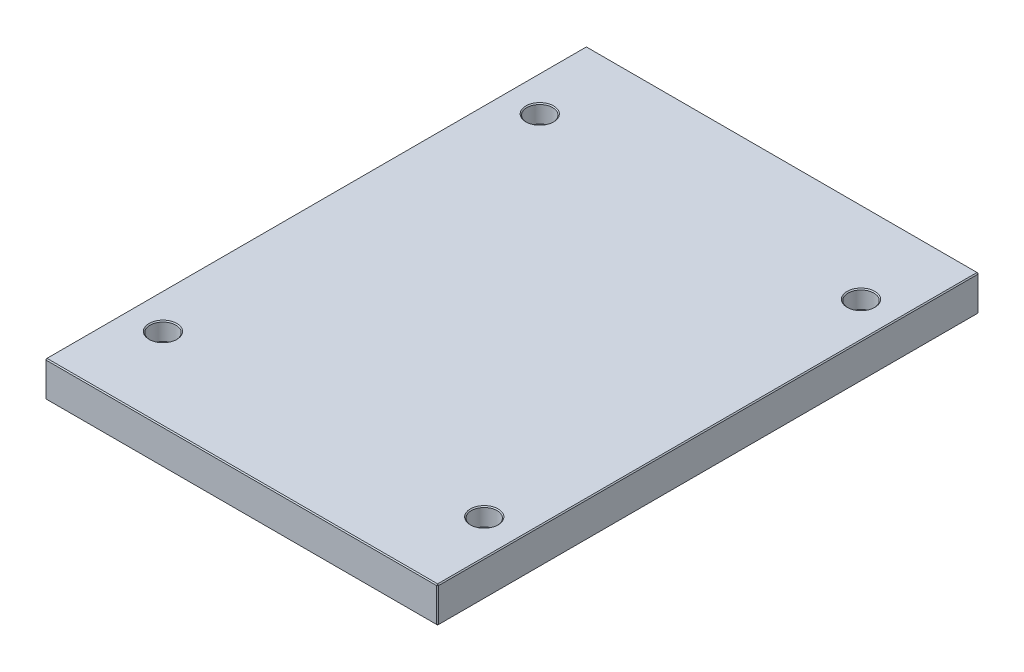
ISO-10303-21;
HEADER;
FILE_DESCRIPTION(('STEP AP214'),'2;1');
FILE_NAME('part.step','',(''),(''),'','','');
FILE_SCHEMA(('AUTOMOTIVE_DESIGN { 1 0 10303 214 1 1 1 1 }'));
ENDSEC;
DATA;
#1=APPLICATION_CONTEXT('core data for automotive mechanical design processes');
#2=APPLICATION_PROTOCOL_DEFINITION('international standard','automotive_design',2000,#1);
#3=PRODUCT_CONTEXT('',#1,'mechanical');
#4=PRODUCT('Part','Part','',(#3));
#5=PRODUCT_RELATED_PRODUCT_CATEGORY('part','',(#4));
#6=PRODUCT_DEFINITION_FORMATION('','',#4);
#7=PRODUCT_DEFINITION_CONTEXT('part definition',#1,'design');
#8=PRODUCT_DEFINITION('design','',#6,#7);
#9=PRODUCT_DEFINITION_SHAPE('','',#8);
#10=(LENGTH_UNIT() NAMED_UNIT(*) SI_UNIT(.MILLI.,.METRE.));
#11=(NAMED_UNIT(*) PLANE_ANGLE_UNIT() SI_UNIT($,.RADIAN.));
#12=(NAMED_UNIT(*) SI_UNIT($,.STERADIAN.) SOLID_ANGLE_UNIT());
#13=UNCERTAINTY_MEASURE_WITH_UNIT(LENGTH_MEASURE(1.E-05),#10,'distance_accuracy_value','');
#14=(GEOMETRIC_REPRESENTATION_CONTEXT(3) GLOBAL_UNCERTAINTY_ASSIGNED_CONTEXT((#13)) GLOBAL_UNIT_ASSIGNED_CONTEXT((#10,
#11,#12)) REPRESENTATION_CONTEXT('',''));
#15=CARTESIAN_POINT('',(0.,0.,0.));
#16=DIRECTION('',(0.,0.,1.));
#17=DIRECTION('',(1.,0.,0.));
#18=AXIS2_PLACEMENT_3D('',#15,#16,#17);
#19=CARTESIAN_POINT('',(-198.,36.,273.));
#20=DIRECTION('',(1.,0.,0.));
#21=DIRECTION('',(0.,0.,-1.));
#22=AXIS2_PLACEMENT_3D('',#19,#20,#21);
#23=PLANE('',#22);
#24=DIRECTION('',(0.,-1.,0.));
#25=VECTOR('',#24,1.);
#26=CARTESIAN_POINT('',(-198.,36.,-272.));
#27=LINE('',#26,#25);
#28=CARTESIAN_POINT('',(-198.,35.,-272.));
#29=VERTEX_POINT('',#28);
#30=CARTESIAN_POINT('',(-198.,1.,-272.));
#31=VERTEX_POINT('',#30);
#32=EDGE_CURVE('E115',#29,#31,#27,.T.);
#33=ORIENTED_EDGE('',*,*,#32,.T.);
#34=DIRECTION('',(0.,0.,1.));
#35=VECTOR('',#34,1.);
#36=CARTESIAN_POINT('',(-198.,1.,273.));
#37=LINE('',#36,#35);
#38=CARTESIAN_POINT('',(-198.,1.,272.));
#39=VERTEX_POINT('',#38);
#40=EDGE_CURVE('E111',#31,#39,#37,.T.);
#41=ORIENTED_EDGE('',*,*,#40,.T.);
#42=DIRECTION('',(0.,1.,0.));
#43=VECTOR('',#42,1.);
#44=CARTESIAN_POINT('',(-198.,36.,272.));
#45=LINE('',#44,#43);
#46=CARTESIAN_POINT('',(-198.,35.,272.));
#47=VERTEX_POINT('',#46);
#48=EDGE_CURVE('E104',#39,#47,#45,.T.);
#49=ORIENTED_EDGE('',*,*,#48,.T.);
#50=DIRECTION('',(0.,0.,-1.));
#51=VECTOR('',#50,1.);
#52=CARTESIAN_POINT('',(-198.,35.,-273.));
#53=LINE('',#52,#51);
#54=EDGE_CURVE('E108',#47,#29,#53,.T.);
#55=ORIENTED_EDGE('',*,*,#54,.T.);
#56=EDGE_LOOP('',(#33,#41,#49,#55));
#57=FACE_BOUND('',#56,.T.);
#58=ADVANCED_FACE('F16',(#57),#23,.F.);
#59=CARTESIAN_POINT('',(198.,36.,273.));
#60=DIRECTION('',(0.,0.,-1.));
#61=DIRECTION('',(-1.,0.,0.));
#62=AXIS2_PLACEMENT_3D('',#59,#60,#61);
#63=PLANE('',#62);
#64=DIRECTION('',(-1.,0.,0.));
#65=VECTOR('',#64,1.);
#66=CARTESIAN_POINT('',(-198.,35.,273.));
#67=LINE('',#66,#65);
#68=CARTESIAN_POINT('',(197.,35.,273.));
#69=VERTEX_POINT('',#68);
#70=CARTESIAN_POINT('',(-197.,35.,273.));
#71=VERTEX_POINT('',#70);
#72=EDGE_CURVE('E170',#69,#71,#67,.T.);
#73=ORIENTED_EDGE('',*,*,#72,.T.);
#74=DIRECTION('',(0.,-1.,0.));
#75=VECTOR('',#74,1.);
#76=CARTESIAN_POINT('',(-197.,36.,273.));
#77=LINE('',#76,#75);
#78=CARTESIAN_POINT('',(-197.,1.,273.));
#79=VERTEX_POINT('',#78);
#80=EDGE_CURVE('E123',#71,#79,#77,.T.);
#81=ORIENTED_EDGE('',*,*,#80,.T.);
#82=DIRECTION('',(1.,0.,0.));
#83=VECTOR('',#82,1.);
#84=CARTESIAN_POINT('',(198.,1.,273.));
#85=LINE('',#84,#83);
#86=CARTESIAN_POINT('',(197.,1.,273.));
#87=VERTEX_POINT('',#86);
#88=EDGE_CURVE('E174',#79,#87,#85,.T.);
#89=ORIENTED_EDGE('',*,*,#88,.T.);
#90=DIRECTION('',(0.,1.,0.));
#91=VECTOR('',#90,1.);
#92=CARTESIAN_POINT('',(197.,36.,273.));
#93=LINE('',#92,#91);
#94=EDGE_CURVE('E172',#87,#69,#93,.T.);
#95=ORIENTED_EDGE('',*,*,#94,.T.);
#96=EDGE_LOOP('',(#73,#81,#89,#95));
#97=FACE_BOUND('',#96,.T.);
#98=ADVANCED_FACE('F317',(#97),#63,.F.);
#99=CARTESIAN_POINT('',(198.,36.,273.));
#100=DIRECTION('',(-1.,0.,0.));
#101=DIRECTION('',(0.,0.,1.));
#102=AXIS2_PLACEMENT_3D('',#99,#100,#101);
#103=PLANE('',#102);
#104=DIRECTION('',(0.,0.,-1.));
#105=VECTOR('',#104,1.);
#106=CARTESIAN_POINT('',(198.,1.,273.));
#107=LINE('',#106,#105);
#108=CARTESIAN_POINT('',(198.,1.,272.));
#109=VERTEX_POINT('',#108);
#110=CARTESIAN_POINT('',(198.,1.,-272.));
#111=VERTEX_POINT('',#110);
#112=EDGE_CURVE('E165',#109,#111,#107,.T.);
#113=ORIENTED_EDGE('',*,*,#112,.T.);
#114=DIRECTION('',(0.,1.,0.));
#115=VECTOR('',#114,1.);
#116=CARTESIAN_POINT('',(198.,36.,-272.));
#117=LINE('',#116,#115);
#118=CARTESIAN_POINT('',(198.,35.,-272.));
#119=VERTEX_POINT('',#118);
#120=EDGE_CURVE('E167',#111,#119,#117,.T.);
#121=ORIENTED_EDGE('',*,*,#120,.T.);
#122=DIRECTION('',(0.,0.,1.));
#123=VECTOR('',#122,1.);
#124=CARTESIAN_POINT('',(198.,35.,273.));
#125=LINE('',#124,#123);
#126=CARTESIAN_POINT('',(198.,35.,272.));
#127=VERTEX_POINT('',#126);
#128=EDGE_CURVE('E161',#119,#127,#125,.T.);
#129=ORIENTED_EDGE('',*,*,#128,.T.);
#130=DIRECTION('',(0.,-1.,0.));
#131=VECTOR('',#130,1.);
#132=CARTESIAN_POINT('',(198.,36.,272.));
#133=LINE('',#132,#131);
#134=EDGE_CURVE('E163',#127,#109,#133,.T.);
#135=ORIENTED_EDGE('',*,*,#134,.T.);
#136=EDGE_LOOP('',(#113,#121,#129,#135));
#137=FACE_BOUND('',#136,.T.);
#138=ADVANCED_FACE('F323',(#137),#103,.F.);
#139=CARTESIAN_POINT('',(198.,36.,-273.));
#140=DIRECTION('',(0.,0.,1.));
#141=DIRECTION('',(1.,0.,0.));
#142=AXIS2_PLACEMENT_3D('',#139,#140,#141);
#143=PLANE('',#142);
#144=DIRECTION('',(0.,-1.,0.));
#145=VECTOR('',#144,1.);
#146=CARTESIAN_POINT('',(197.,36.,-273.));
#147=LINE('',#146,#145);
#148=CARTESIAN_POINT('',(197.,35.,-273.));
#149=VERTEX_POINT('',#148);
#150=CARTESIAN_POINT('',(197.,1.,-273.));
#151=VERTEX_POINT('',#150);
#152=EDGE_CURVE('E154',#149,#151,#147,.T.);
#153=ORIENTED_EDGE('',*,*,#152,.T.);
#154=DIRECTION('',(-1.,0.,0.));
#155=VECTOR('',#154,1.);
#156=CARTESIAN_POINT('',(198.,1.,-273.));
#157=LINE('',#156,#155);
#158=CARTESIAN_POINT('',(-197.,1.,-273.));
#159=VERTEX_POINT('',#158);
#160=EDGE_CURVE('E159',#151,#159,#157,.T.);
#161=ORIENTED_EDGE('',*,*,#160,.T.);
#162=DIRECTION('',(0.,1.,0.));
#163=VECTOR('',#162,1.);
#164=CARTESIAN_POINT('',(-197.,36.,-273.));
#165=LINE('',#164,#163);
#166=CARTESIAN_POINT('',(-197.,35.,-273.));
#167=VERTEX_POINT('',#166);
#168=EDGE_CURVE('E156',#159,#167,#165,.T.);
#169=ORIENTED_EDGE('',*,*,#168,.T.);
#170=DIRECTION('',(1.,0.,0.));
#171=VECTOR('',#170,1.);
#172=CARTESIAN_POINT('',(198.,35.,-273.));
#173=LINE('',#172,#171);
#174=EDGE_CURVE('E152',#167,#149,#173,.T.);
#175=ORIENTED_EDGE('',*,*,#174,.T.);
#176=EDGE_LOOP('',(#153,#161,#169,#175));
#177=FACE_BOUND('',#176,.T.);
#178=ADVANCED_FACE('F465',(#177),#143,.F.);
#179=CARTESIAN_POINT('',(0.,36.,0.));
#180=DIRECTION('',(0.,1.,0.));
#181=DIRECTION('',(0.,0.,1.));
#182=AXIS2_PLACEMENT_3D('',#179,#180,#181);
#183=PLANE('',#182);
#184=CARTESIAN_POINT('',(-162.,36.,190.));
#185=DIRECTION('',(0.,1.,0.));
#186=DIRECTION('',(0.,0.,1.));
#187=AXIS2_PLACEMENT_3D('',#184,#185,#186);
#188=CIRCLE('',#187,14.);
#189=CARTESIAN_POINT('',(-162.,36.,204.));
#190=VERTEX_POINT('',#189);
#191=EDGE_CURVE('E290',#190,#190,#188,.F.);
#192=ORIENTED_EDGE('',*,*,#191,.T.);
#193=EDGE_LOOP('',(#192));
#194=FACE_BOUND('',#193,.T.);
#195=CARTESIAN_POINT('',(162.,36.,190.));
#196=DIRECTION('',(0.,1.,0.));
#197=DIRECTION('',(0.,0.,1.));
#198=AXIS2_PLACEMENT_3D('',#195,#196,#197);
#199=CIRCLE('',#198,14.);
#200=CARTESIAN_POINT('',(162.,36.,204.));
#201=VERTEX_POINT('',#200);
#202=EDGE_CURVE('E287',#201,#201,#199,.F.);
#203=ORIENTED_EDGE('',*,*,#202,.T.);
#204=EDGE_LOOP('',(#203));
#205=FACE_BOUND('',#204,.T.);
#206=CARTESIAN_POINT('',(162.,36.,-190.));
#207=DIRECTION('',(0.,1.,0.));
#208=DIRECTION('',(0.,0.,1.));
#209=AXIS2_PLACEMENT_3D('',#206,#207,#208);
#210=CIRCLE('',#209,14.);
#211=CARTESIAN_POINT('',(162.,36.,-176.));
#212=VERTEX_POINT('',#211);
#213=EDGE_CURVE('E284',#212,#212,#210,.F.);
#214=ORIENTED_EDGE('',*,*,#213,.T.);
#215=EDGE_LOOP('',(#214));
#216=FACE_BOUND('',#215,.T.);
#217=CARTESIAN_POINT('',(-162.,36.,-190.));
#218=DIRECTION('',(0.,1.,0.));
#219=DIRECTION('',(0.,0.,1.));
#220=AXIS2_PLACEMENT_3D('',#217,#218,#219);
#221=CIRCLE('',#220,14.);
#222=CARTESIAN_POINT('',(-162.,36.,-176.));
#223=VERTEX_POINT('',#222);
#224=EDGE_CURVE('E281',#223,#223,#221,.F.);
#225=ORIENTED_EDGE('',*,*,#224,.T.);
#226=EDGE_LOOP('',(#225));
#227=FACE_BOUND('',#226,.T.);
#228=DIRECTION('',(0.,0.,-1.));
#229=VECTOR('',#228,1.);
#230=CARTESIAN_POINT('',(197.,36.,-273.));
#231=LINE('',#230,#229);
#232=CARTESIAN_POINT('',(197.,36.,272.));
#233=VERTEX_POINT('',#232);
#234=CARTESIAN_POINT('',(197.,36.,-272.));
#235=VERTEX_POINT('',#234);
#236=EDGE_CURVE('E31',#233,#235,#231,.T.);
#237=ORIENTED_EDGE('',*,*,#236,.T.);
#238=DIRECTION('',(-1.,0.,0.));
#239=VECTOR('',#238,1.);
#240=CARTESIAN_POINT('',(-198.,36.,-272.));
#241=LINE('',#240,#239);
#242=CARTESIAN_POINT('',(-197.,36.,-272.));
#243=VERTEX_POINT('',#242);
#244=EDGE_CURVE('E190',#235,#243,#241,.T.);
#245=ORIENTED_EDGE('',*,*,#244,.T.);
#246=DIRECTION('',(0.,0.,1.));
#247=VECTOR('',#246,1.);
#248=CARTESIAN_POINT('',(-197.,36.,273.));
#249=LINE('',#248,#247);
#250=CARTESIAN_POINT('',(-197.,36.,272.));
#251=VERTEX_POINT('',#250);
#252=EDGE_CURVE('E186',#243,#251,#249,.T.);
#253=ORIENTED_EDGE('',*,*,#252,.T.);
#254=DIRECTION('',(1.,0.,0.));
#255=VECTOR('',#254,1.);
#256=CARTESIAN_POINT('',(198.,36.,272.));
#257=LINE('',#256,#255);
#258=EDGE_CURVE('E36',#251,#233,#257,.T.);
#259=ORIENTED_EDGE('',*,*,#258,.T.);
#260=EDGE_LOOP('',(#237,#245,#253,#259));
#261=FACE_BOUND('',#260,.T.);
#262=ADVANCED_FACE('F462',(#194,#205,#216,#227,#261),#183,.T.);
#263=CARTESIAN_POINT('',(0.,0.,0.));
#264=DIRECTION('',(0.,1.,0.));
#265=DIRECTION('',(0.,0.,1.));
#266=AXIS2_PLACEMENT_3D('',#263,#264,#265);
#267=PLANE('',#266);
#268=CARTESIAN_POINT('',(162.,0.,-190.));
#269=DIRECTION('',(0.,1.,0.));
#270=DIRECTION('',(0.,0.,1.));
#271=AXIS2_PLACEMENT_3D('',#268,#269,#270);
#272=CIRCLE('',#271,9.99999999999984);
#273=CARTESIAN_POINT('',(162.,0.,-180.));
#274=VERTEX_POINT('',#273);
#275=EDGE_CURVE('E263',#274,#274,#272,.T.);
#276=ORIENTED_EDGE('',*,*,#275,.T.);
#277=EDGE_LOOP('',(#276));
#278=FACE_BOUND('',#277,.T.);
#279=CARTESIAN_POINT('',(162.,0.,190.));
#280=DIRECTION('',(0.,1.,0.));
#281=DIRECTION('',(0.,0.,1.));
#282=AXIS2_PLACEMENT_3D('',#279,#280,#281);
#283=CIRCLE('',#282,9.99999999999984);
#284=CARTESIAN_POINT('',(162.,0.,200.));
#285=VERTEX_POINT('',#284);
#286=EDGE_CURVE('E260',#285,#285,#283,.T.);
#287=ORIENTED_EDGE('',*,*,#286,.T.);
#288=EDGE_LOOP('',(#287));
#289=FACE_BOUND('',#288,.T.);
#290=CARTESIAN_POINT('',(-162.,0.,190.));
#291=DIRECTION('',(0.,1.,0.));
#292=DIRECTION('',(0.,0.,1.));
#293=AXIS2_PLACEMENT_3D('',#290,#291,#292);
#294=CIRCLE('',#293,10.);
#295=CARTESIAN_POINT('',(-162.,0.,200.));
#296=VERTEX_POINT('',#295);
#297=EDGE_CURVE('E257',#296,#296,#294,.T.);
#298=ORIENTED_EDGE('',*,*,#297,.T.);
#299=EDGE_LOOP('',(#298));
#300=FACE_BOUND('',#299,.T.);
#301=CARTESIAN_POINT('',(-162.,0.,-190.));
#302=DIRECTION('',(0.,1.,0.));
#303=DIRECTION('',(0.,0.,1.));
#304=AXIS2_PLACEMENT_3D('',#301,#302,#303);
#305=CIRCLE('',#304,10.);
#306=CARTESIAN_POINT('',(-162.,0.,-180.));
#307=VERTEX_POINT('',#306);
#308=EDGE_CURVE('E192',#307,#307,#305,.T.);
#309=ORIENTED_EDGE('',*,*,#308,.T.);
#310=EDGE_LOOP('',(#309));
#311=FACE_BOUND('',#310,.T.);
#312=DIRECTION('',(0.,0.,1.));
#313=VECTOR('',#312,1.);
#314=CARTESIAN_POINT('',(197.,0.,0.));
#315=LINE('',#314,#313);
#316=CARTESIAN_POINT('',(197.,0.,-272.));
#317=VERTEX_POINT('',#316);
#318=CARTESIAN_POINT('',(197.,0.,272.));
#319=VERTEX_POINT('',#318);
#320=EDGE_CURVE('E177',#317,#319,#315,.T.);
#321=ORIENTED_EDGE('',*,*,#320,.T.);
#322=DIRECTION('',(-1.,0.,0.));
#323=VECTOR('',#322,1.);
#324=CARTESIAN_POINT('',(0.,0.,272.));
#325=LINE('',#324,#323);
#326=CARTESIAN_POINT('',(-197.,0.,272.));
#327=VERTEX_POINT('',#326);
#328=EDGE_CURVE('E183',#319,#327,#325,.T.);
#329=ORIENTED_EDGE('',*,*,#328,.T.);
#330=DIRECTION('',(0.,0.,-1.));
#331=VECTOR('',#330,1.);
#332=CARTESIAN_POINT('',(-197.,0.,0.));
#333=LINE('',#332,#331);
#334=CARTESIAN_POINT('',(-197.,0.,-272.));
#335=VERTEX_POINT('',#334);
#336=EDGE_CURVE('E181',#327,#335,#333,.T.);
#337=ORIENTED_EDGE('',*,*,#336,.T.);
#338=DIRECTION('',(1.,0.,0.));
#339=VECTOR('',#338,1.);
#340=CARTESIAN_POINT('',(0.,0.,-272.));
#341=LINE('',#340,#339);
#342=EDGE_CURVE('E179',#335,#317,#341,.T.);
#343=ORIENTED_EDGE('',*,*,#342,.T.);
#344=EDGE_LOOP('',(#321,#329,#337,#343));
#345=FACE_BOUND('',#344,.T.);
#346=ADVANCED_FACE('F402',(#278,#289,#300,#311,#345),#267,.F.);
#347=CARTESIAN_POINT('',(198.,36.,272.));
#348=DIRECTION('',(-0.707106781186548,0.,-0.707106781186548));
#349=DIRECTION('',(0.,-1.,0.));
#350=AXIS2_PLACEMENT_3D('',#347,#348,#349);
#351=PLANE('',#350);
#352=DIRECTION('',(-0.707106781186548,0.,0.707106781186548));
#353=VECTOR('',#352,1.);
#354=CARTESIAN_POINT('',(197.,35.,273.));
#355=LINE('',#354,#353);
#356=EDGE_CURVE('E141',#69,#127,#355,.F.);
#357=ORIENTED_EDGE('',*,*,#356,.F.);
#358=ORIENTED_EDGE('',*,*,#94,.F.);
#359=DIRECTION('',(0.707106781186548,0.,-0.707106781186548));
#360=VECTOR('',#359,1.);
#361=CARTESIAN_POINT('',(197.,1.,273.));
#362=LINE('',#361,#360);
#363=EDGE_CURVE('E144',#109,#87,#362,.F.);
#364=ORIENTED_EDGE('',*,*,#363,.F.);
#365=ORIENTED_EDGE('',*,*,#134,.F.);
#366=EDGE_LOOP('',(#357,#358,#364,#365));
#367=FACE_BOUND('',#366,.T.);
#368=ADVANCED_FACE('F398',(#367),#351,.F.);
#369=CARTESIAN_POINT('',(197.,35.,273.));
#370=DIRECTION('',(0.577350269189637,0.577350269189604,0.577350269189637));
#371=DIRECTION('',(0.707106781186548,0.,-0.707106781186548));
#372=AXIS2_PLACEMENT_3D('',#369,#370,#371);
#373=PLANE('',#372);
#374=DIRECTION('',(0.,-0.707106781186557,0.707106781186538));
#375=VECTOR('',#374,1.);
#376=CARTESIAN_POINT('',(197.,35.,273.));
#377=LINE('',#376,#375);
#378=EDGE_CURVE('E235',#69,#233,#377,.F.);
#379=ORIENTED_EDGE('',*,*,#378,.F.);
#380=ORIENTED_EDGE('',*,*,#356,.T.);
#381=DIRECTION('',(-0.707106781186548,0.707106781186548,0.));
#382=VECTOR('',#381,1.);
#383=CARTESIAN_POINT('',(197.5,35.5,272.));
#384=LINE('',#383,#382);
#385=EDGE_CURVE('E237',#233,#127,#384,.F.);
#386=ORIENTED_EDGE('',*,*,#385,.F.);
#387=EDGE_LOOP('',(#379,#380,#386));
#388=FACE_BOUND('',#387,.T.);
#389=ADVANCED_FACE('F394',(#388),#373,.T.);
#390=CARTESIAN_POINT('',(197.,1.,273.));
#391=DIRECTION('',(0.577350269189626,-0.577350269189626,0.577350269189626));
#392=DIRECTION('',(0.707106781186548,0.,-0.707106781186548));
#393=AXIS2_PLACEMENT_3D('',#390,#391,#392);
#394=PLANE('',#393);
#395=DIRECTION('',(-0.707106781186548,-0.707106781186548,0.));
#396=VECTOR('',#395,1.);
#397=CARTESIAN_POINT('',(197.5,0.5,272.));
#398=LINE('',#397,#396);
#399=EDGE_CURVE('E229',#109,#319,#398,.T.);
#400=ORIENTED_EDGE('',*,*,#399,.F.);
#401=ORIENTED_EDGE('',*,*,#363,.T.);
#402=DIRECTION('',(0.,0.707106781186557,0.707106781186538));
#403=VECTOR('',#402,1.);
#404=CARTESIAN_POINT('',(197.,1.,273.));
#405=LINE('',#404,#403);
#406=EDGE_CURVE('E232',#319,#87,#405,.T.);
#407=ORIENTED_EDGE('',*,*,#406,.F.);
#408=EDGE_LOOP('',(#400,#401,#407));
#409=FACE_BOUND('',#408,.T.);
#410=ADVANCED_FACE('F390',(#409),#394,.T.);
#411=CARTESIAN_POINT('',(197.,36.,0.));
#412=DIRECTION('',(0.707106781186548,0.707106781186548,0.));
#413=DIRECTION('',(0.,0.,1.));
#414=AXIS2_PLACEMENT_3D('',#411,#412,#413);
#415=PLANE('',#414);
#416=ORIENTED_EDGE('',*,*,#385,.T.);
#417=ORIENTED_EDGE('',*,*,#128,.F.);
#418=DIRECTION('',(0.707106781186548,-0.707106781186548,0.));
#419=VECTOR('',#418,1.);
#420=CARTESIAN_POINT('',(198.,35.,-272.));
#421=LINE('',#420,#419);
#422=EDGE_CURVE('E224',#235,#119,#421,.T.);
#423=ORIENTED_EDGE('',*,*,#422,.F.);
#424=ORIENTED_EDGE('',*,*,#236,.F.);
#425=EDGE_LOOP('',(#416,#417,#423,#424));
#426=FACE_BOUND('',#425,.T.);
#427=ADVANCED_FACE('F386',(#426),#415,.T.);
#428=CARTESIAN_POINT('',(0.,36.,272.));
#429=DIRECTION('',(0.,0.707106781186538,0.707106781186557));
#430=DIRECTION('',(-1.,0.,0.));
#431=AXIS2_PLACEMENT_3D('',#428,#429,#430);
#432=PLANE('',#431);
#433=ORIENTED_EDGE('',*,*,#378,.T.);
#434=ORIENTED_EDGE('',*,*,#258,.F.);
#435=DIRECTION('',(0.,0.707106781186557,-0.707106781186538));
#436=VECTOR('',#435,1.);
#437=CARTESIAN_POINT('',(-197.,35.5,272.5));
#438=LINE('',#437,#436);
#439=EDGE_CURVE('E127',#71,#251,#438,.T.);
#440=ORIENTED_EDGE('',*,*,#439,.F.);
#441=ORIENTED_EDGE('',*,*,#72,.F.);
#442=EDGE_LOOP('',(#433,#434,#440,#441));
#443=FACE_BOUND('',#442,.T.);
#444=ADVANCED_FACE('F383',(#443),#432,.T.);
#445=CARTESIAN_POINT('',(-197.,36.,273.));
#446=DIRECTION('',(0.707106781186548,0.,-0.707106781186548));
#447=DIRECTION('',(0.,-1.,0.));
#448=AXIS2_PLACEMENT_3D('',#445,#446,#447);
#449=PLANE('',#448);
#450=DIRECTION('',(0.707106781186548,0.,0.707106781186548));
#451=VECTOR('',#450,1.);
#452=CARTESIAN_POINT('',(-197.,1.,273.));
#453=LINE('',#452,#451);
#454=EDGE_CURVE('E128',#79,#39,#453,.F.);
#455=ORIENTED_EDGE('',*,*,#454,.F.);
#456=ORIENTED_EDGE('',*,*,#80,.F.);
#457=DIRECTION('',(-0.707106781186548,0.,-0.707106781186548));
#458=VECTOR('',#457,1.);
#459=CARTESIAN_POINT('',(-198.,35.,272.));
#460=LINE('',#459,#458);
#461=EDGE_CURVE('E119',#47,#71,#460,.F.);
#462=ORIENTED_EDGE('',*,*,#461,.F.);
#463=ORIENTED_EDGE('',*,*,#48,.F.);
#464=EDGE_LOOP('',(#455,#456,#462,#463));
#465=FACE_BOUND('',#464,.T.);
#466=ADVANCED_FACE('F121',(#465),#449,.F.);
#467=CARTESIAN_POINT('',(198.,1.,273.));
#468=DIRECTION('',(0.,0.707106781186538,-0.707106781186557));
#469=DIRECTION('',(1.,0.,0.));
#470=AXIS2_PLACEMENT_3D('',#467,#468,#469);
#471=PLANE('',#470);
#472=ORIENTED_EDGE('',*,*,#406,.T.);
#473=ORIENTED_EDGE('',*,*,#88,.F.);
#474=DIRECTION('',(0.,-0.707106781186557,-0.707106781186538));
#475=VECTOR('',#474,1.);
#476=CARTESIAN_POINT('',(-197.,1.,273.));
#477=LINE('',#476,#475);
#478=EDGE_CURVE('E220',#327,#79,#477,.F.);
#479=ORIENTED_EDGE('',*,*,#478,.F.);
#480=ORIENTED_EDGE('',*,*,#328,.F.);
#481=EDGE_LOOP('',(#472,#473,#479,#480));
#482=FACE_BOUND('',#481,.T.);
#483=ADVANCED_FACE('F376',(#482),#471,.F.);
#484=CARTESIAN_POINT('',(198.,1.,273.));
#485=DIRECTION('',(-0.707106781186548,0.707106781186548,0.));
#486=DIRECTION('',(0.,0.,-1.));
#487=AXIS2_PLACEMENT_3D('',#484,#485,#486);
#488=PLANE('',#487);
#489=ORIENTED_EDGE('',*,*,#399,.T.);
#490=ORIENTED_EDGE('',*,*,#320,.F.);
#491=DIRECTION('',(0.707106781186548,0.707106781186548,0.));
#492=VECTOR('',#491,1.);
#493=CARTESIAN_POINT('',(197.5,0.500000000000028,-272.));
#494=LINE('',#493,#492);
#495=EDGE_CURVE('E217',#111,#317,#494,.F.);
#496=ORIENTED_EDGE('',*,*,#495,.F.);
#497=ORIENTED_EDGE('',*,*,#112,.F.);
#498=EDGE_LOOP('',(#489,#490,#496,#497));
#499=FACE_BOUND('',#498,.T.);
#500=ADVANCED_FACE('F372',(#499),#488,.F.);
#501=CARTESIAN_POINT('',(197.,36.,-273.));
#502=DIRECTION('',(-0.707106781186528,0.,0.707106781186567));
#503=DIRECTION('',(0.,-1.,0.));
#504=AXIS2_PLACEMENT_3D('',#501,#502,#503);
#505=PLANE('',#504);
#506=DIRECTION('',(0.707106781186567,0.,0.707106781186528));
#507=VECTOR('',#506,1.);
#508=CARTESIAN_POINT('',(198.,35.,-272.));
#509=LINE('',#508,#507);
#510=EDGE_CURVE('E226',#119,#149,#509,.F.);
#511=ORIENTED_EDGE('',*,*,#510,.F.);
#512=ORIENTED_EDGE('',*,*,#120,.F.);
#513=DIRECTION('',(-0.707106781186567,0.,-0.707106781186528));
#514=VECTOR('',#513,1.);
#515=CARTESIAN_POINT('',(197.,1.,-273.));
#516=LINE('',#515,#514);
#517=EDGE_CURVE('E214',#151,#111,#516,.F.);
#518=ORIENTED_EDGE('',*,*,#517,.F.);
#519=ORIENTED_EDGE('',*,*,#152,.F.);
#520=EDGE_LOOP('',(#511,#512,#518,#519));
#521=FACE_BOUND('',#520,.T.);
#522=ADVANCED_FACE('F368',(#521),#505,.F.);
#523=CARTESIAN_POINT('',(198.,35.,-272.));
#524=DIRECTION('',(0.577350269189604,0.577350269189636,-0.577350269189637));
#525=DIRECTION('',(0.,0.707106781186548,0.707106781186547));
#526=AXIS2_PLACEMENT_3D('',#523,#524,#525);
#527=PLANE('',#526);
#528=ORIENTED_EDGE('',*,*,#422,.T.);
#529=ORIENTED_EDGE('',*,*,#510,.T.);
#530=DIRECTION('',(0.,0.707106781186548,0.707106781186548));
#531=VECTOR('',#530,1.);
#532=CARTESIAN_POINT('',(197.,35.5,-272.5));
#533=LINE('',#532,#531);
#534=EDGE_CURVE('E135',#235,#149,#533,.F.);
#535=ORIENTED_EDGE('',*,*,#534,.F.);
#536=EDGE_LOOP('',(#528,#529,#535));
#537=FACE_BOUND('',#536,.T.);
#538=ADVANCED_FACE('F365',(#537),#527,.T.);
#539=CARTESIAN_POINT('',(-198.,35.,272.));
#540=DIRECTION('',(-0.577350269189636,0.577350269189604,0.577350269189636));
#541=DIRECTION('',(0.707106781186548,0.,0.707106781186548));
#542=AXIS2_PLACEMENT_3D('',#539,#540,#541);
#543=PLANE('',#542);
#544=ORIENTED_EDGE('',*,*,#461,.T.);
#545=ORIENTED_EDGE('',*,*,#439,.T.);
#546=DIRECTION('',(-0.707106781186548,-0.707106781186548,0.));
#547=VECTOR('',#546,1.);
#548=CARTESIAN_POINT('',(-198.,35.,272.));
#549=LINE('',#548,#547);
#550=EDGE_CURVE('E131',#47,#251,#549,.F.);
#551=ORIENTED_EDGE('',*,*,#550,.F.);
#552=EDGE_LOOP('',(#544,#545,#551));
#553=FACE_BOUND('',#552,.T.);
#554=ADVANCED_FACE('F132',(#553),#543,.T.);
#555=CARTESIAN_POINT('',(-197.,1.,273.));
#556=DIRECTION('',(-0.577350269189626,-0.577350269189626,0.577350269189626));
#557=DIRECTION('',(0.707106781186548,0.,0.707106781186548));
#558=AXIS2_PLACEMENT_3D('',#555,#556,#557);
#559=PLANE('',#558);
#560=ORIENTED_EDGE('',*,*,#478,.T.);
#561=ORIENTED_EDGE('',*,*,#454,.T.);
#562=DIRECTION('',(-0.707106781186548,0.707106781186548,0.));
#563=VECTOR('',#562,1.);
#564=CARTESIAN_POINT('',(-197.5,0.5,272.));
#565=LINE('',#564,#563);
#566=EDGE_CURVE('E136',#327,#39,#565,.T.);
#567=ORIENTED_EDGE('',*,*,#566,.F.);
#568=EDGE_LOOP('',(#560,#561,#567));
#569=FACE_BOUND('',#568,.T.);
#570=ADVANCED_FACE('F358',(#569),#559,.T.);
#571=CARTESIAN_POINT('',(197.,1.,-273.));
#572=DIRECTION('',(0.577350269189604,-0.577350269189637,-0.577350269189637));
#573=DIRECTION('',(0.,0.707106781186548,-0.707106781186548));
#574=AXIS2_PLACEMENT_3D('',#571,#572,#573);
#575=PLANE('',#574);
#576=ORIENTED_EDGE('',*,*,#517,.T.);
#577=ORIENTED_EDGE('',*,*,#495,.T.);
#578=DIRECTION('',(0.,-0.707106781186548,0.707106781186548));
#579=VECTOR('',#578,1.);
#580=CARTESIAN_POINT('',(197.,1.,-273.));
#581=LINE('',#580,#579);
#582=EDGE_CURVE('E207',#151,#317,#581,.T.);
#583=ORIENTED_EDGE('',*,*,#582,.F.);
#584=EDGE_LOOP('',(#576,#577,#583));
#585=FACE_BOUND('',#584,.T.);
#586=ADVANCED_FACE('F354',(#585),#575,.T.);
#587=CARTESIAN_POINT('',(0.,36.,-272.));
#588=DIRECTION('',(0.,0.707106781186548,-0.707106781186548));
#589=DIRECTION('',(1.,0.,0.));
#590=AXIS2_PLACEMENT_3D('',#587,#588,#589);
#591=PLANE('',#590);
#592=ORIENTED_EDGE('',*,*,#534,.T.);
#593=ORIENTED_EDGE('',*,*,#174,.F.);
#594=DIRECTION('',(0.,-0.707106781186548,-0.707106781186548));
#595=VECTOR('',#594,1.);
#596=CARTESIAN_POINT('',(-197.,35.,-273.));
#597=LINE('',#596,#595);
#598=EDGE_CURVE('E204',#243,#167,#597,.T.);
#599=ORIENTED_EDGE('',*,*,#598,.F.);
#600=ORIENTED_EDGE('',*,*,#244,.F.);
#601=EDGE_LOOP('',(#592,#593,#599,#600));
#602=FACE_BOUND('',#601,.T.);
#603=ADVANCED_FACE('F351',(#602),#591,.T.);
#604=CARTESIAN_POINT('',(-197.,36.,0.));
#605=DIRECTION('',(-0.707106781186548,0.707106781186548,0.));
#606=DIRECTION('',(0.,0.,-1.));
#607=AXIS2_PLACEMENT_3D('',#604,#605,#606);
#608=PLANE('',#607);
#609=ORIENTED_EDGE('',*,*,#550,.T.);
#610=ORIENTED_EDGE('',*,*,#252,.F.);
#611=DIRECTION('',(0.707106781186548,0.707106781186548,0.));
#612=VECTOR('',#611,1.);
#613=CARTESIAN_POINT('',(-197.5,35.5,-272.));
#614=LINE('',#613,#612);
#615=EDGE_CURVE('E139',#29,#243,#614,.T.);
#616=ORIENTED_EDGE('',*,*,#615,.F.);
#617=ORIENTED_EDGE('',*,*,#54,.F.);
#618=EDGE_LOOP('',(#609,#610,#616,#617));
#619=FACE_BOUND('',#618,.T.);
#620=ADVANCED_FACE('F138',(#619),#608,.T.);
#621=CARTESIAN_POINT('',(-198.,1.,273.));
#622=DIRECTION('',(0.707106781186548,0.707106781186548,0.));
#623=DIRECTION('',(0.,0.,1.));
#624=AXIS2_PLACEMENT_3D('',#621,#622,#623);
#625=PLANE('',#624);
#626=ORIENTED_EDGE('',*,*,#566,.T.);
#627=ORIENTED_EDGE('',*,*,#40,.F.);
#628=DIRECTION('',(0.707106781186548,-0.707106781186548,0.));
#629=VECTOR('',#628,1.);
#630=CARTESIAN_POINT('',(-198.,1.,-272.));
#631=LINE('',#630,#629);
#632=EDGE_CURVE('E200',#335,#31,#631,.F.);
#633=ORIENTED_EDGE('',*,*,#632,.F.);
#634=ORIENTED_EDGE('',*,*,#336,.F.);
#635=EDGE_LOOP('',(#626,#627,#633,#634));
#636=FACE_BOUND('',#635,.T.);
#637=ADVANCED_FACE('F344',(#636),#625,.F.);
#638=CARTESIAN_POINT('',(198.,1.,-273.));
#639=DIRECTION('',(0.,0.707106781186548,0.707106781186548));
#640=DIRECTION('',(-1.,0.,0.));
#641=AXIS2_PLACEMENT_3D('',#638,#639,#640);
#642=PLANE('',#641);
#643=ORIENTED_EDGE('',*,*,#582,.T.);
#644=ORIENTED_EDGE('',*,*,#342,.F.);
#645=DIRECTION('',(0.,0.707106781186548,-0.707106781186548));
#646=VECTOR('',#645,1.);
#647=CARTESIAN_POINT('',(-197.,0.5,-272.5));
#648=LINE('',#647,#646);
#649=EDGE_CURVE('E197',#159,#335,#648,.F.);
#650=ORIENTED_EDGE('',*,*,#649,.F.);
#651=ORIENTED_EDGE('',*,*,#160,.F.);
#652=EDGE_LOOP('',(#643,#644,#650,#651));
#653=FACE_BOUND('',#652,.T.);
#654=ADVANCED_FACE('F340',(#653),#642,.F.);
#655=CARTESIAN_POINT('',(-197.,35.,-273.));
#656=DIRECTION('',(-0.577350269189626,0.577350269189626,-0.577350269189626));
#657=DIRECTION('',(-0.707106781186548,0.,0.707106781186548));
#658=AXIS2_PLACEMENT_3D('',#655,#656,#657);
#659=PLANE('',#658);
#660=ORIENTED_EDGE('',*,*,#615,.T.);
#661=ORIENTED_EDGE('',*,*,#598,.T.);
#662=DIRECTION('',(0.707106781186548,0.,-0.707106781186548));
#663=VECTOR('',#662,1.);
#664=CARTESIAN_POINT('',(-197.,35.,-273.));
#665=LINE('',#664,#663);
#666=EDGE_CURVE('E195',#29,#167,#665,.T.);
#667=ORIENTED_EDGE('',*,*,#666,.F.);
#668=EDGE_LOOP('',(#660,#661,#667));
#669=FACE_BOUND('',#668,.T.);
#670=ADVANCED_FACE('F336',(#669),#659,.T.);
#671=CARTESIAN_POINT('',(-198.,1.,-272.));
#672=DIRECTION('',(-0.577350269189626,-0.577350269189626,-0.577350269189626));
#673=DIRECTION('',(-0.707106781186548,0.,0.707106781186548));
#674=AXIS2_PLACEMENT_3D('',#671,#672,#673);
#675=PLANE('',#674);
#676=ORIENTED_EDGE('',*,*,#649,.T.);
#677=ORIENTED_EDGE('',*,*,#632,.T.);
#678=DIRECTION('',(-0.707106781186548,0.,0.707106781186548));
#679=VECTOR('',#678,1.);
#680=CARTESIAN_POINT('',(-198.,1.,-272.));
#681=LINE('',#680,#679);
#682=EDGE_CURVE('E193',#159,#31,#681,.T.);
#683=ORIENTED_EDGE('',*,*,#682,.F.);
#684=EDGE_LOOP('',(#676,#677,#683));
#685=FACE_BOUND('',#684,.T.);
#686=ADVANCED_FACE('F332',(#685),#675,.T.);
#687=CARTESIAN_POINT('',(-198.,36.,-272.));
#688=DIRECTION('',(0.707106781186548,0.,0.707106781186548));
#689=DIRECTION('',(0.,-1.,0.));
#690=AXIS2_PLACEMENT_3D('',#687,#688,#689);
#691=PLANE('',#690);
#692=ORIENTED_EDGE('',*,*,#666,.T.);
#693=ORIENTED_EDGE('',*,*,#168,.F.);
#694=ORIENTED_EDGE('',*,*,#682,.T.);
#695=ORIENTED_EDGE('',*,*,#32,.F.);
#696=EDGE_LOOP('',(#692,#693,#694,#695));
#697=FACE_BOUND('',#696,.T.);
#698=ADVANCED_FACE('F328',(#697),#691,.F.);
#699=CARTESIAN_POINT('',(-162.,18.,-190.));
#700=DIRECTION('',(0.,1.,0.));
#701=DIRECTION('',(0.,0.,1.));
#702=AXIS2_PLACEMENT_3D('',#699,#700,#701);
#703=CYLINDRICAL_SURFACE('',#702,13.);
#704=CARTESIAN_POINT('',(-162.,35.,-190.));
#705=DIRECTION('',(0.,1.,0.));
#706=DIRECTION('',(0.,0.,1.));
#707=AXIS2_PLACEMENT_3D('',#704,#705,#706);
#708=CIRCLE('',#707,13.);
#709=CARTESIAN_POINT('',(-162.,35.,-177.));
#710=VERTEX_POINT('',#709);
#711=EDGE_CURVE('E10',#710,#710,#708,.T.);
#712=ORIENTED_EDGE('',*,*,#711,.T.);
#713=EDGE_LOOP('',(#712));
#714=FACE_BOUND('',#713,.T.);
#715=CARTESIAN_POINT('',(-162.,18.,-190.));
#716=DIRECTION('',(0.,1.,0.));
#717=DIRECTION('',(0.,0.,1.));
#718=AXIS2_PLACEMENT_3D('',#715,#716,#717);
#719=CIRCLE('',#718,13.);
#720=CARTESIAN_POINT('',(-162.,18.,-177.));
#721=VERTEX_POINT('',#720);
#722=EDGE_CURVE('E147',#721,#721,#719,.T.);
#723=ORIENTED_EDGE('',*,*,#722,.F.);
#724=EDGE_LOOP('',(#723));
#725=FACE_BOUND('',#724,.T.);
#726=ADVANCED_FACE('F331',(#714,#725),#703,.F.);
#727=CARTESIAN_POINT('',(-162.,18.,-190.));
#728=DIRECTION('',(0.,1.,0.));
#729=DIRECTION('',(0.,0.,1.));
#730=AXIS2_PLACEMENT_3D('',#727,#728,#729);
#731=PLANE('',#730);
#732=CARTESIAN_POINT('',(-162.,18.,-190.));
#733=DIRECTION('',(0.,1.,0.));
#734=DIRECTION('',(0.,0.,1.));
#735=AXIS2_PLACEMENT_3D('',#732,#733,#734);
#736=CIRCLE('',#735,9.);
#737=CARTESIAN_POINT('',(-162.,18.,-181.));
#738=VERTEX_POINT('',#737);
#739=EDGE_CURVE('E251',#738,#738,#736,.T.);
#740=ORIENTED_EDGE('',*,*,#739,.F.);
#741=EDGE_LOOP('',(#740));
#742=FACE_BOUND('',#741,.T.);
#743=ORIENTED_EDGE('',*,*,#722,.T.);
#744=EDGE_LOOP('',(#743));
#745=FACE_BOUND('',#744,.T.);
#746=ADVANCED_FACE('F450',(#742,#745),#731,.T.);
#747=CARTESIAN_POINT('',(162.,18.,-190.));
#748=DIRECTION('',(0.,1.,0.));
#749=DIRECTION('',(0.,0.,1.));
#750=AXIS2_PLACEMENT_3D('',#747,#748,#749);
#751=CYLINDRICAL_SURFACE('',#750,13.);
#752=CARTESIAN_POINT('',(162.,35.,-190.));
#753=DIRECTION('',(0.,1.,0.));
#754=DIRECTION('',(0.,0.,1.));
#755=AXIS2_PLACEMENT_3D('',#752,#753,#754);
#756=CIRCLE('',#755,13.);
#757=CARTESIAN_POINT('',(162.,35.,-177.));
#758=VERTEX_POINT('',#757);
#759=EDGE_CURVE('E24',#758,#758,#756,.T.);
#760=ORIENTED_EDGE('',*,*,#759,.T.);
#761=EDGE_LOOP('',(#760));
#762=FACE_BOUND('',#761,.T.);
#763=CARTESIAN_POINT('',(162.,18.,-190.));
#764=DIRECTION('',(0.,1.,0.));
#765=DIRECTION('',(0.,0.,1.));
#766=AXIS2_PLACEMENT_3D('',#763,#764,#765);
#767=CIRCLE('',#766,13.);
#768=CARTESIAN_POINT('',(162.,18.,-177.));
#769=VERTEX_POINT('',#768);
#770=EDGE_CURVE('E441',#769,#769,#767,.T.);
#771=ORIENTED_EDGE('',*,*,#770,.F.);
#772=EDGE_LOOP('',(#771));
#773=FACE_BOUND('',#772,.T.);
#774=ADVANCED_FACE('F298',(#762,#773),#751,.F.);
#775=CARTESIAN_POINT('',(162.,18.,-190.));
#776=DIRECTION('',(0.,1.,0.));
#777=DIRECTION('',(0.,0.,1.));
#778=AXIS2_PLACEMENT_3D('',#775,#776,#777);
#779=PLANE('',#778);
#780=CARTESIAN_POINT('',(162.,18.,-190.));
#781=DIRECTION('',(0.,1.,0.));
#782=DIRECTION('',(0.,0.,1.));
#783=AXIS2_PLACEMENT_3D('',#780,#781,#782);
#784=CIRCLE('',#783,9.);
#785=CARTESIAN_POINT('',(162.,18.,-181.));
#786=VERTEX_POINT('',#785);
#787=EDGE_CURVE('E248',#786,#786,#784,.T.);
#788=ORIENTED_EDGE('',*,*,#787,.F.);
#789=EDGE_LOOP('',(#788));
#790=FACE_BOUND('',#789,.T.);
#791=ORIENTED_EDGE('',*,*,#770,.T.);
#792=EDGE_LOOP('',(#791));
#793=FACE_BOUND('',#792,.T.);
#794=ADVANCED_FACE('F738',(#790,#793),#779,.T.);
#795=CARTESIAN_POINT('',(162.,18.,190.));
#796=DIRECTION('',(0.,1.,0.));
#797=DIRECTION('',(0.,0.,1.));
#798=AXIS2_PLACEMENT_3D('',#795,#796,#797);
#799=CYLINDRICAL_SURFACE('',#798,13.);
#800=CARTESIAN_POINT('',(162.,35.,190.));
#801=DIRECTION('',(0.,1.,0.));
#802=DIRECTION('',(0.,0.,1.));
#803=AXIS2_PLACEMENT_3D('',#800,#801,#802);
#804=CIRCLE('',#803,13.);
#805=CARTESIAN_POINT('',(162.,35.,203.));
#806=VERTEX_POINT('',#805);
#807=EDGE_CURVE('E293',#806,#806,#804,.T.);
#808=ORIENTED_EDGE('',*,*,#807,.T.);
#809=EDGE_LOOP('',(#808));
#810=FACE_BOUND('',#809,.T.);
#811=CARTESIAN_POINT('',(162.,18.,190.));
#812=DIRECTION('',(0.,1.,0.));
#813=DIRECTION('',(0.,0.,1.));
#814=AXIS2_PLACEMENT_3D('',#811,#812,#813);
#815=CIRCLE('',#814,13.);
#816=CARTESIAN_POINT('',(162.,18.,203.));
#817=VERTEX_POINT('',#816);
#818=EDGE_CURVE('E439',#817,#817,#815,.T.);
#819=ORIENTED_EDGE('',*,*,#818,.F.);
#820=EDGE_LOOP('',(#819));
#821=FACE_BOUND('',#820,.T.);
#822=ADVANCED_FACE('F730',(#810,#821),#799,.F.);
#823=CARTESIAN_POINT('',(162.,18.,190.));
#824=DIRECTION('',(0.,1.,0.));
#825=DIRECTION('',(0.,0.,1.));
#826=AXIS2_PLACEMENT_3D('',#823,#824,#825);
#827=PLANE('',#826);
#828=CARTESIAN_POINT('',(162.,18.,190.));
#829=DIRECTION('',(0.,1.,0.));
#830=DIRECTION('',(0.,0.,1.));
#831=AXIS2_PLACEMENT_3D('',#828,#829,#830);
#832=CIRCLE('',#831,9.);
#833=CARTESIAN_POINT('',(162.,18.,199.));
#834=VERTEX_POINT('',#833);
#835=EDGE_CURVE('E245',#834,#834,#832,.T.);
#836=ORIENTED_EDGE('',*,*,#835,.F.);
#837=EDGE_LOOP('',(#836));
#838=FACE_BOUND('',#837,.T.);
#839=ORIENTED_EDGE('',*,*,#818,.T.);
#840=EDGE_LOOP('',(#839));
#841=FACE_BOUND('',#840,.T.);
#842=ADVANCED_FACE('F434',(#838,#841),#827,.T.);
#843=CARTESIAN_POINT('',(-162.,18.,190.));
#844=DIRECTION('',(0.,1.,0.));
#845=DIRECTION('',(0.,0.,1.));
#846=AXIS2_PLACEMENT_3D('',#843,#844,#845);
#847=CYLINDRICAL_SURFACE('',#846,13.);
#848=CARTESIAN_POINT('',(-162.,35.,190.));
#849=DIRECTION('',(0.,1.,0.));
#850=DIRECTION('',(0.,0.,1.));
#851=AXIS2_PLACEMENT_3D('',#848,#849,#850);
#852=CIRCLE('',#851,13.);
#853=CARTESIAN_POINT('',(-162.,35.,203.));
#854=VERTEX_POINT('',#853);
#855=EDGE_CURVE('E278',#854,#854,#852,.T.);
#856=ORIENTED_EDGE('',*,*,#855,.T.);
#857=EDGE_LOOP('',(#856));
#858=FACE_BOUND('',#857,.T.);
#859=CARTESIAN_POINT('',(-162.,18.,190.));
#860=DIRECTION('',(0.,1.,0.));
#861=DIRECTION('',(0.,0.,1.));
#862=AXIS2_PLACEMENT_3D('',#859,#860,#861);
#863=CIRCLE('',#862,13.);
#864=CARTESIAN_POINT('',(-162.,18.,203.));
#865=VERTEX_POINT('',#864);
#866=EDGE_CURVE('E254',#865,#865,#863,.T.);
#867=ORIENTED_EDGE('',*,*,#866,.F.);
#868=EDGE_LOOP('',(#867));
#869=FACE_BOUND('',#868,.T.);
#870=ADVANCED_FACE('F430',(#858,#869),#847,.F.);
#871=CARTESIAN_POINT('',(-162.,18.,190.));
#872=DIRECTION('',(0.,1.,0.));
#873=DIRECTION('',(0.,0.,1.));
#874=AXIS2_PLACEMENT_3D('',#871,#872,#873);
#875=PLANE('',#874);
#876=CARTESIAN_POINT('',(-162.,18.,190.));
#877=DIRECTION('',(0.,1.,0.));
#878=DIRECTION('',(0.,0.,1.));
#879=AXIS2_PLACEMENT_3D('',#876,#877,#878);
#880=CIRCLE('',#879,9.);
#881=CARTESIAN_POINT('',(-162.,18.,199.));
#882=VERTEX_POINT('',#881);
#883=EDGE_CURVE('E242',#882,#882,#880,.T.);
#884=ORIENTED_EDGE('',*,*,#883,.F.);
#885=EDGE_LOOP('',(#884));
#886=FACE_BOUND('',#885,.T.);
#887=ORIENTED_EDGE('',*,*,#866,.T.);
#888=EDGE_LOOP('',(#887));
#889=FACE_BOUND('',#888,.T.);
#890=ADVANCED_FACE('F433',(#886,#889),#875,.T.);
#891=CARTESIAN_POINT('',(-162.,0.,190.));
#892=DIRECTION('',(0.,1.,0.));
#893=DIRECTION('',(0.,0.,1.));
#894=AXIS2_PLACEMENT_3D('',#891,#892,#893);
#895=CYLINDRICAL_SURFACE('',#894,9.);
#896=CARTESIAN_POINT('',(-162.,0.999999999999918,190.));
#897=DIRECTION('',(0.,1.,0.));
#898=DIRECTION('',(0.,0.,1.));
#899=AXIS2_PLACEMENT_3D('',#896,#897,#898);
#900=CIRCLE('',#899,9.);
#901=CARTESIAN_POINT('',(-162.,0.999999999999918,199.));
#902=VERTEX_POINT('',#901);
#903=EDGE_CURVE('E272',#902,#902,#900,.F.);
#904=ORIENTED_EDGE('',*,*,#903,.T.);
#905=EDGE_LOOP('',(#904));
#906=FACE_BOUND('',#905,.T.);
#907=ORIENTED_EDGE('',*,*,#883,.T.);
#908=EDGE_LOOP('',(#907));
#909=FACE_BOUND('',#908,.T.);
#910=ADVANCED_FACE('F705',(#906,#909),#895,.F.);
#911=CARTESIAN_POINT('',(162.,0.,190.));
#912=DIRECTION('',(0.,1.,0.));
#913=DIRECTION('',(0.,0.,1.));
#914=AXIS2_PLACEMENT_3D('',#911,#912,#913);
#915=CYLINDRICAL_SURFACE('',#914,9.);
#916=CARTESIAN_POINT('',(162.,0.999999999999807,190.));
#917=DIRECTION('',(0.,1.,0.));
#918=DIRECTION('',(0.,0.,1.));
#919=AXIS2_PLACEMENT_3D('',#916,#917,#918);
#920=CIRCLE('',#919,9.);
#921=CARTESIAN_POINT('',(162.,0.999999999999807,199.));
#922=VERTEX_POINT('',#921);
#923=EDGE_CURVE('E269',#922,#922,#920,.F.);
#924=ORIENTED_EDGE('',*,*,#923,.T.);
#925=EDGE_LOOP('',(#924));
#926=FACE_BOUND('',#925,.T.);
#927=ORIENTED_EDGE('',*,*,#835,.T.);
#928=EDGE_LOOP('',(#927));
#929=FACE_BOUND('',#928,.T.);
#930=ADVANCED_FACE('F697',(#926,#929),#915,.F.);
#931=CARTESIAN_POINT('',(162.,0.,-190.));
#932=DIRECTION('',(0.,1.,0.));
#933=DIRECTION('',(0.,0.,1.));
#934=AXIS2_PLACEMENT_3D('',#931,#932,#933);
#935=CYLINDRICAL_SURFACE('',#934,9.);
#936=CARTESIAN_POINT('',(162.,0.999999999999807,-190.));
#937=DIRECTION('',(0.,1.,0.));
#938=DIRECTION('',(0.,0.,1.));
#939=AXIS2_PLACEMENT_3D('',#936,#937,#938);
#940=CIRCLE('',#939,9.);
#941=CARTESIAN_POINT('',(162.,0.999999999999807,-181.));
#942=VERTEX_POINT('',#941);
#943=EDGE_CURVE('E266',#942,#942,#940,.F.);
#944=ORIENTED_EDGE('',*,*,#943,.T.);
#945=EDGE_LOOP('',(#944));
#946=FACE_BOUND('',#945,.T.);
#947=ORIENTED_EDGE('',*,*,#787,.T.);
#948=EDGE_LOOP('',(#947));
#949=FACE_BOUND('',#948,.T.);
#950=ADVANCED_FACE('F688',(#946,#949),#935,.F.);
#951=CARTESIAN_POINT('',(-162.,0.,-190.));
#952=DIRECTION('',(0.,1.,0.));
#953=DIRECTION('',(0.,0.,1.));
#954=AXIS2_PLACEMENT_3D('',#951,#952,#953);
#955=CYLINDRICAL_SURFACE('',#954,9.);
#956=CARTESIAN_POINT('',(-162.,0.999999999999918,-190.));
#957=DIRECTION('',(0.,1.,0.));
#958=DIRECTION('',(0.,0.,1.));
#959=AXIS2_PLACEMENT_3D('',#956,#957,#958);
#960=CIRCLE('',#959,9.);
#961=CARTESIAN_POINT('',(-162.,0.999999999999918,-181.));
#962=VERTEX_POINT('',#961);
#963=EDGE_CURVE('E275',#962,#962,#960,.F.);
#964=ORIENTED_EDGE('',*,*,#963,.T.);
#965=EDGE_LOOP('',(#964));
#966=FACE_BOUND('',#965,.T.);
#967=ORIENTED_EDGE('',*,*,#739,.T.);
#968=EDGE_LOOP('',(#967));
#969=FACE_BOUND('',#968,.T.);
#970=ADVANCED_FACE('F408',(#966,#969),#955,.F.);
#971=CARTESIAN_POINT('',(162.,0.,-190.));
#972=DIRECTION('',(0.,-1.,0.));
#973=DIRECTION('',(0.,0.,-1.));
#974=AXIS2_PLACEMENT_3D('',#971,#972,#973);
#975=CONICAL_SURFACE('',#974,9.99999999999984,0.78539816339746);
#976=ORIENTED_EDGE('',*,*,#943,.F.);
#977=EDGE_LOOP('',(#976));
#978=FACE_BOUND('',#977,.T.);
#979=ORIENTED_EDGE('',*,*,#275,.F.);
#980=EDGE_LOOP('',(#979));
#981=FACE_BOUND('',#980,.T.);
#982=ADVANCED_FACE('F404',(#978,#981),#975,.F.);
#983=CARTESIAN_POINT('',(162.,0.,190.));
#984=DIRECTION('',(0.,-1.,0.));
#985=DIRECTION('',(0.,0.,-1.));
#986=AXIS2_PLACEMENT_3D('',#983,#984,#985);
#987=CONICAL_SURFACE('',#986,9.99999999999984,0.78539816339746);
#988=ORIENTED_EDGE('',*,*,#923,.F.);
#989=EDGE_LOOP('',(#988));
#990=FACE_BOUND('',#989,.T.);
#991=ORIENTED_EDGE('',*,*,#286,.F.);
#992=EDGE_LOOP('',(#991));
#993=FACE_BOUND('',#992,.T.);
#994=ADVANCED_FACE('F407',(#990,#993),#987,.F.);
#995=CARTESIAN_POINT('',(-162.,0.,190.));
#996=DIRECTION('',(0.,-1.,0.));
#997=DIRECTION('',(0.,0.,-1.));
#998=AXIS2_PLACEMENT_3D('',#995,#996,#997);
#999=CONICAL_SURFACE('',#998,10.,0.78539816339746);
#1000=ORIENTED_EDGE('',*,*,#903,.F.);
#1001=EDGE_LOOP('',(#1000));
#1002=FACE_BOUND('',#1001,.T.);
#1003=ORIENTED_EDGE('',*,*,#297,.F.);
#1004=EDGE_LOOP('',(#1003));
#1005=FACE_BOUND('',#1004,.T.);
#1006=ADVANCED_FACE('F412',(#1002,#1005),#999,.F.);
#1007=CARTESIAN_POINT('',(-162.,0.,-190.));
#1008=DIRECTION('',(0.,-1.,0.));
#1009=DIRECTION('',(0.,0.,-1.));
#1010=AXIS2_PLACEMENT_3D('',#1007,#1008,#1009);
#1011=CONICAL_SURFACE('',#1010,10.,0.78539816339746);
#1012=ORIENTED_EDGE('',*,*,#963,.F.);
#1013=EDGE_LOOP('',(#1012));
#1014=FACE_BOUND('',#1013,.T.);
#1015=ORIENTED_EDGE('',*,*,#308,.F.);
#1016=EDGE_LOOP('',(#1015));
#1017=FACE_BOUND('',#1016,.T.);
#1018=ADVANCED_FACE('F416',(#1014,#1017),#1011,.F.);
#1019=CARTESIAN_POINT('',(-162.,35.,190.));
#1020=DIRECTION('',(0.,1.,0.));
#1021=DIRECTION('',(0.,0.,1.));
#1022=AXIS2_PLACEMENT_3D('',#1019,#1020,#1021);
#1023=CONICAL_SURFACE('',#1022,13.,0.785398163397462);
#1024=ORIENTED_EDGE('',*,*,#191,.F.);
#1025=EDGE_LOOP('',(#1024));
#1026=FACE_BOUND('',#1025,.T.);
#1027=ORIENTED_EDGE('',*,*,#855,.F.);
#1028=EDGE_LOOP('',(#1027));
#1029=FACE_BOUND('',#1028,.T.);
#1030=ADVANCED_FACE('F312',(#1026,#1029),#1023,.F.);
#1031=CARTESIAN_POINT('',(162.,35.,190.));
#1032=DIRECTION('',(0.,1.,0.));
#1033=DIRECTION('',(0.,0.,1.));
#1034=AXIS2_PLACEMENT_3D('',#1031,#1032,#1033);
#1035=CONICAL_SURFACE('',#1034,13.,0.785398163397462);
#1036=ORIENTED_EDGE('',*,*,#202,.F.);
#1037=EDGE_LOOP('',(#1036));
#1038=FACE_BOUND('',#1037,.T.);
#1039=ORIENTED_EDGE('',*,*,#807,.F.);
#1040=EDGE_LOOP('',(#1039));
#1041=FACE_BOUND('',#1040,.T.);
#1042=ADVANCED_FACE('F303',(#1038,#1041),#1035,.F.);
#1043=CARTESIAN_POINT('',(162.,35.,-190.));
#1044=DIRECTION('',(0.,1.,0.));
#1045=DIRECTION('',(0.,0.,1.));
#1046=AXIS2_PLACEMENT_3D('',#1043,#1044,#1045);
#1047=CONICAL_SURFACE('',#1046,13.,0.785398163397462);
#1048=ORIENTED_EDGE('',*,*,#213,.F.);
#1049=EDGE_LOOP('',(#1048));
#1050=FACE_BOUND('',#1049,.T.);
#1051=ORIENTED_EDGE('',*,*,#759,.F.);
#1052=EDGE_LOOP('',(#1051));
#1053=FACE_BOUND('',#1052,.T.);
#1054=ADVANCED_FACE('F301',(#1050,#1053),#1047,.F.);
#1055=CARTESIAN_POINT('',(-162.,35.,-190.));
#1056=DIRECTION('',(0.,1.,0.));
#1057=DIRECTION('',(0.,0.,1.));
#1058=AXIS2_PLACEMENT_3D('',#1055,#1056,#1057);
#1059=CONICAL_SURFACE('',#1058,13.,0.785398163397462);
#1060=ORIENTED_EDGE('',*,*,#224,.F.);
#1061=EDGE_LOOP('',(#1060));
#1062=FACE_BOUND('',#1061,.T.);
#1063=ORIENTED_EDGE('',*,*,#711,.F.);
#1064=EDGE_LOOP('',(#1063));
#1065=FACE_BOUND('',#1064,.T.);
#1066=ADVANCED_FACE('F18',(#1062,#1065),#1059,.F.);
#1067=CLOSED_SHELL('',(#58,#98,#138,#178,#262,#346,#368,#389,#410,#427,#444,#466,#483,#500,#522,
#538,#554,#570,#586,#603,#620,#637,#654,#670,#686,#698,#726,#746,#774,#794,#822,#842,#870,#890,
#910,#930,#950,#970,#982,#994,#1006,#1018,#1030,#1042,#1054,#1066));
#1068=MANIFOLD_SOLID_BREP('B1',#1067);
#1069=ADVANCED_BREP_SHAPE_REPRESENTATION('',(#18,#1068),#14);
#1070=SHAPE_DEFINITION_REPRESENTATION(#9,#1069);
ENDSEC;
END-ISO-10303-21;
